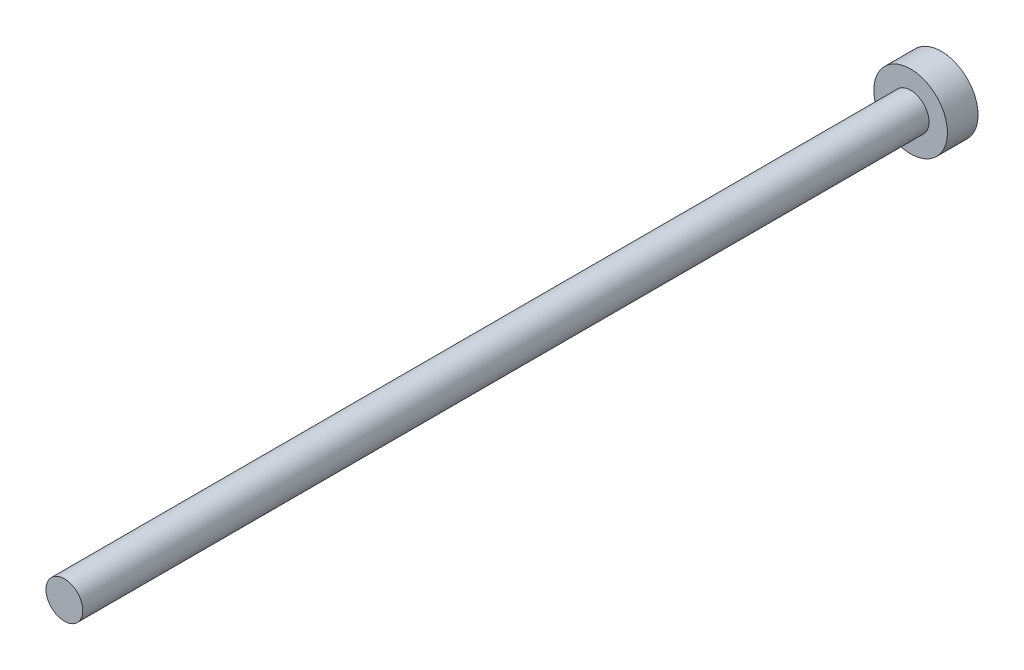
ISO-10303-21;
HEADER;
FILE_DESCRIPTION(('STEP AP214'),'2;1');
FILE_NAME('part.step','',(''),(''),'','','');
FILE_SCHEMA(('AUTOMOTIVE_DESIGN { 1 0 10303 214 1 1 1 1 }'));
ENDSEC;
DATA;
#1=APPLICATION_CONTEXT('core data for automotive mechanical design processes');
#2=APPLICATION_PROTOCOL_DEFINITION('international standard','automotive_design',2000,#1);
#3=PRODUCT_CONTEXT('',#1,'mechanical');
#4=PRODUCT('Part','Part','',(#3));
#5=PRODUCT_RELATED_PRODUCT_CATEGORY('part','',(#4));
#6=PRODUCT_DEFINITION_FORMATION('','',#4);
#7=PRODUCT_DEFINITION_CONTEXT('part definition',#1,'design');
#8=PRODUCT_DEFINITION('design','',#6,#7);
#9=PRODUCT_DEFINITION_SHAPE('','',#8);
#10=(LENGTH_UNIT() NAMED_UNIT(*) SI_UNIT(.MILLI.,.METRE.));
#11=(NAMED_UNIT(*) PLANE_ANGLE_UNIT() SI_UNIT($,.RADIAN.));
#12=(NAMED_UNIT(*) SI_UNIT($,.STERADIAN.) SOLID_ANGLE_UNIT());
#13=UNCERTAINTY_MEASURE_WITH_UNIT(LENGTH_MEASURE(1.E-05),#10,'distance_accuracy_value','');
#14=(GEOMETRIC_REPRESENTATION_CONTEXT(3) GLOBAL_UNCERTAINTY_ASSIGNED_CONTEXT((#13)) GLOBAL_UNIT_ASSIGNED_CONTEXT((#10,
#11,#12)) REPRESENTATION_CONTEXT('',''));
#15=CARTESIAN_POINT('',(0.,0.,0.));
#16=DIRECTION('',(0.,0.,1.));
#17=DIRECTION('',(1.,0.,0.));
#18=AXIS2_PLACEMENT_3D('',#15,#16,#17);
#19=CARTESIAN_POINT('',(35.0000080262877,51.0956836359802,-917.3));
#20=DIRECTION('',(0.,0.,1.));
#21=DIRECTION('',(1.,0.,0.));
#22=AXIS2_PLACEMENT_3D('',#19,#20,#21);
#23=CYLINDRICAL_SURFACE('',#22,3.);
#24=CARTESIAN_POINT('',(35.0000080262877,51.0956836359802,0.));
#25=DIRECTION('',(0.,0.,1.));
#26=DIRECTION('',(1.,0.,0.));
#27=AXIS2_PLACEMENT_3D('',#24,#25,#26);
#28=CIRCLE('',#27,3.);
#29=CARTESIAN_POINT('',(38.0000080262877,51.0956836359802,0.));
#30=VERTEX_POINT('',#29);
#31=EDGE_CURVE('E20',#30,#30,#28,.T.);
#32=ORIENTED_EDGE('',*,*,#31,.F.);
#33=EDGE_LOOP('',(#32));
#34=FACE_BOUND('',#33,.T.);
#35=CARTESIAN_POINT('',(35.0000080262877,51.0956836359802,-138.));
#36=DIRECTION('',(0.,0.,-1.));
#37=DIRECTION('',(-1.,0.,0.));
#38=AXIS2_PLACEMENT_3D('',#35,#36,#37);
#39=CIRCLE('',#38,3.);
#40=CARTESIAN_POINT('',(32.0000080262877,51.0956836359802,-138.));
#41=VERTEX_POINT('',#40);
#42=EDGE_CURVE('E10',#41,#41,#39,.T.);
#43=ORIENTED_EDGE('',*,*,#42,.F.);
#44=EDGE_LOOP('',(#43));
#45=FACE_BOUND('',#44,.T.);
#46=ADVANCED_FACE('F14',(#34,#45),#23,.T.);
#47=CARTESIAN_POINT('',(-56.8,64.515,0.));
#48=DIRECTION('',(0.,0.,1.));
#49=DIRECTION('',(1.,0.,0.));
#50=AXIS2_PLACEMENT_3D('',#47,#48,#49);
#51=PLANE('',#50);
#52=ORIENTED_EDGE('',*,*,#31,.T.);
#53=EDGE_LOOP('',(#52));
#54=FACE_BOUND('',#53,.T.);
#55=ADVANCED_FACE('F46',(#54),#51,.T.);
#56=CARTESIAN_POINT('',(35.0000080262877,51.0956836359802,-138.));
#57=DIRECTION('',(0.,0.,-1.));
#58=DIRECTION('',(-1.,0.,0.));
#59=AXIS2_PLACEMENT_3D('',#56,#57,#58);
#60=PLANE('',#59);
#61=CARTESIAN_POINT('',(35.0000080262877,51.0956836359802,-138.));
#62=DIRECTION('',(0.,0.,-1.));
#63=DIRECTION('',(-1.,0.,0.));
#64=AXIS2_PLACEMENT_3D('',#61,#62,#63);
#65=CIRCLE('',#64,6.);
#66=CARTESIAN_POINT('',(29.0000080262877,51.0956836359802,-138.));
#67=VERTEX_POINT('',#66);
#68=EDGE_CURVE('E24',#67,#67,#65,.T.);
#69=ORIENTED_EDGE('',*,*,#68,.F.);
#70=EDGE_LOOP('',(#69));
#71=FACE_BOUND('',#70,.T.);
#72=ORIENTED_EDGE('',*,*,#42,.T.);
#73=EDGE_LOOP('',(#72));
#74=FACE_BOUND('',#73,.T.);
#75=ADVANCED_FACE('F38',(#71,#74),#60,.F.);
#76=CARTESIAN_POINT('',(35.0000080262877,51.0956836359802,-138.));
#77=DIRECTION('',(0.,0.,-1.));
#78=DIRECTION('',(-1.,0.,0.));
#79=AXIS2_PLACEMENT_3D('',#76,#77,#78);
#80=CYLINDRICAL_SURFACE('',#79,6.);
#81=ORIENTED_EDGE('',*,*,#68,.T.);
#82=EDGE_LOOP('',(#81));
#83=FACE_BOUND('',#82,.T.);
#84=CARTESIAN_POINT('',(35.0000080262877,51.0956836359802,-143.));
#85=DIRECTION('',(0.,0.,-1.));
#86=DIRECTION('',(-1.,0.,0.));
#87=AXIS2_PLACEMENT_3D('',#84,#85,#86);
#88=CIRCLE('',#87,6.);
#89=CARTESIAN_POINT('',(29.0000080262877,51.0956836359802,-143.));
#90=VERTEX_POINT('',#89);
#91=EDGE_CURVE('E28',#90,#90,#88,.T.);
#92=ORIENTED_EDGE('',*,*,#91,.F.);
#93=EDGE_LOOP('',(#92));
#94=FACE_BOUND('',#93,.T.);
#95=ADVANCED_FACE('F36',(#83,#94),#80,.T.);
#96=CARTESIAN_POINT('',(35.0000080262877,30.,-143.));
#97=DIRECTION('',(0.,0.,-1.));
#98=DIRECTION('',(-1.,0.,0.));
#99=AXIS2_PLACEMENT_3D('',#96,#97,#98);
#100=PLANE('',#99);
#101=ORIENTED_EDGE('',*,*,#91,.T.);
#102=EDGE_LOOP('',(#101));
#103=FACE_BOUND('',#102,.T.);
#104=ADVANCED_FACE('F34',(#103),#100,.T.);
#105=CLOSED_SHELL('',(#46,#55,#75,#95,#104));
#106=MANIFOLD_SOLID_BREP('B1',#105);
#107=ADVANCED_BREP_SHAPE_REPRESENTATION('',(#18,#106),#14);
#108=SHAPE_DEFINITION_REPRESENTATION(#9,#107);
ENDSEC;
END-ISO-10303-21;
